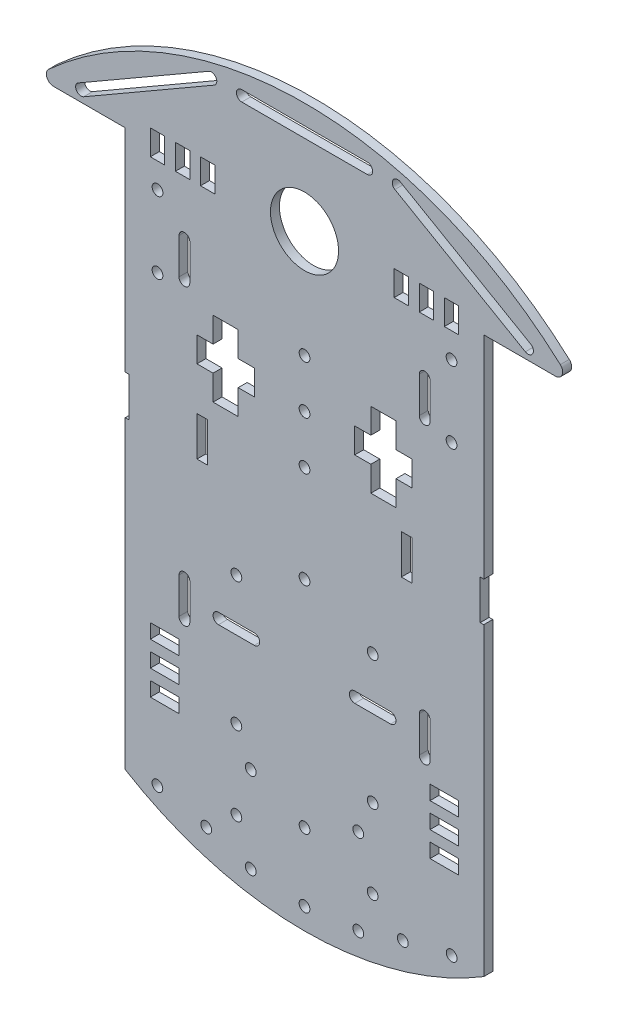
from build123d import *

# Parameters (mm, degrees)
BOSS_EXTRU_1_DEPTH         = 2.5
ESQUISSE2_R                = 9.5
ENL_V_MAT_EXTRU_1_DEPTH    = 223.451892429
ESQUISSE3_W                = 4
ESQUISSE3_H                = 7
ENL_V_MAT_EXTRU_2_DEPTH    = 223.451892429
R_P_TITION_LIN_AIRE1_COUNT = 3
R_P_TITION_LIN_AIRE1_PITCH = 7
ENL_V_MAT_EXTRU_3_DEPTH    = 223.451892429
ESQUISSE5_W                = 3
ESQUISSE5_H                = 11
ENL_V_MAT_EXTRU_4_DEPTH    = 223.451892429
R_P_TITION_LIN_AIRE2_COUNT = 2
R_P_TITION_LIN_AIRE2_PITCH = 22
ESQUISSE6_R                = 1.5
ENL_V_MAT_EXTRU_5_DEPTH    = 223.451892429
ESQUISSE7_W                = 8
ESQUISSE7_H                = 4
ENL_V_MAT_EXTRU_6_DEPTH    = 223.451892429
SYM_TRIE1_COPY_1_SKETCH_W  = 4
SYM_TRIE1_COPY_1_SKETCH_H  = 7
SYM_TRIE1_COPY_1_DEPTH     = 223.451892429
SYM_TRIE1_COPY_2_SKETCH_W  = 4
SYM_TRIE1_COPY_2_SKETCH_H  = 7
SYM_TRIE1_COPY_2_DEPTH     = 223.451892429
SYM_TRIE1_COPY_3_SKETCH_W  = 3
SYM_TRIE1_COPY_3_SKETCH_H  = 11
SYM_TRIE1_COPY_3_DEPTH     = 223.451892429
ESQUISSE8_R                = 1.5
ENL_V_MAT_EXTRU_7_DEPTH    = 10


with BuildPart() as part:
    # Esquisse1 → Boss.-Extru.1 (new body)
    with BuildSketch(Plane.XY):
        with BuildLine():
            Line((100, 155), (119.994239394, 155))
            ThreePointArc((119.994239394, 155), (121.860222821, 156.2802043), (121.337366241, 158.48189415))
            ThreePointArc((121.337366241, 158.48189415), (50, 186), (-21.337366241, 158.48189415))
            ThreePointArc((-21.337366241, 158.48189415), (-21.860222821, 156.2802043), (-19.994239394, 155))
            Line((-19.994239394, 155), (0, 155))
            Line((0, 155), (0, 0))
            ThreePointArc((0, 0), (50, -14), (100, 0))
            Line((100, 0), (100, 155))
        make_face()
    extrude(amount=BOSS_EXTRU_1_DEPTH)

    # Esquisse2 → Enl_v. mat.-Extru.1 (cut, through all)
    with BuildSketch(Plane(origin=(0, 0, 0), x_dir=(-1, 0, 0), z_dir=(0, 0, -1))):
        with Locations((-50, 155)):
            Circle(ESQUISSE2_R)
    extrude(amount=-ENL_V_MAT_EXTRU_1_DEPTH, mode=Mode.SUBTRACT)

    # Esquisse3 → Enl_v. mat.-Extru.2 (cut, through all)
    with BuildSketch(Plane(origin=(0, 0, 0), x_dir=(-1, 0, 0), z_dir=(0, 0, -1))):
        with Locations((-91, 155)):
            Rectangle(ESQUISSE3_W, ESQUISSE3_H)
    enl_v_mat_extru_2 = extrude(amount=-ENL_V_MAT_EXTRU_2_DEPTH, mode=Mode.SUBTRACT)

    # R_p_tition lin_aire1: Enl_v. mat.-Extru.2 ×3
    with Locations(*[(-i * R_P_TITION_LIN_AIRE1_PITCH, 0, 0) for i in range(1, R_P_TITION_LIN_AIRE1_COUNT)]):
        add(enl_v_mat_extru_2, mode=Mode.SUBTRACT)

    # Esquisse4 → Enl_v. mat.-Extru.3 (cut, through all)
    with BuildSketch(Plane(origin=(0, 0, 0), x_dir=(-1, 0, 0), z_dir=(0, 0, -1))):
        Polygon((-75.5, 122), (-68.5, 122), (-68.5, 115), (-64, 115), (-64, 108), (-68.5, 108), (-68.5, 101), (-75.5, 101), (-75.5, 108), (-80, 108), (-80, 115), (-75.5, 115), align=None)
    enl_v_mat_extru_3 = extrude(amount=-ENL_V_MAT_EXTRU_3_DEPTH, mode=Mode.SUBTRACT)

    # Esquisse5 → Enl_v. mat.-Extru.4 (cut, through all)
    with BuildSketch(Plane(origin=(0, 0, 0), x_dir=(-1, 0, 0), z_dir=(0, 0, -1))):
        with Locations((-78.5, 90.5)):
            Rectangle(ESQUISSE5_W, ESQUISSE5_H)
    enl_v_mat_extru_4 = extrude(amount=-ENL_V_MAT_EXTRU_4_DEPTH, mode=Mode.SUBTRACT)

    # R_p_tition lin_aire2: Enl_v. mat.-Extru.4 ×2
    with Locations(*[(i * R_P_TITION_LIN_AIRE2_PITCH, 0, 0) for i in range(1, R_P_TITION_LIN_AIRE2_COUNT)]):
        add(enl_v_mat_extru_4, mode=Mode.SUBTRACT)

    # Esquisse6 → Enl_v. mat.-Extru.5 (cut, through all)
    with BuildSketch(Plane(origin=(0, 0, 0), x_dir=(-1, 0, 0), z_dir=(0, 0, -1))):
        with Locations((-91, 144.5)):
            Circle(ESQUISSE6_R)
        with Locations((-91, 124.5)):
            Circle(ESQUISSE6_R)
        with Locations((-65, 17.5)):
            Circle(ESQUISSE6_R)
        with Locations((-69, 26.5)):
            Circle(ESQUISSE6_R)
        with Locations((-91.030029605, 0.602552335)):
            Circle(ESQUISSE6_R)
        with Locations((-77.401365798, -2.600496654)):
            Circle(ESQUISSE6_R)
        with Locations((-69, 4.5)):
            Circle(ESQUISSE6_R)
        with Locations((-65, -6.5)):
            Circle(ESQUISSE6_R)
        with Locations((-69, 62.5)):
            Circle(ESQUISSE6_R)
        with BuildLine():
            Line((-82, 54.5), (-82, 44.5))
            ThreePointArc((-82, 44.5), (-83.5, 43), (-85, 44.5))
            Line((-85, 44.5), (-85, 54.5))
            ThreePointArc((-85, 54.5), (-83.5, 56), (-82, 54.5))
        make_face()
        with BuildLine():
            Line((-74, 51), (-64, 51))
            ThreePointArc((-64, 51), (-62.5, 49.5), (-64, 48))
            Line((-64, 48), (-74, 48))
            ThreePointArc((-74, 48), (-75.5, 49.5), (-74, 51))
        make_face()
        with BuildLine():
            Line((-82, 136.5), (-82, 126.5))
            ThreePointArc((-82, 126.5), (-83.5, 125), (-85, 126.5))
            Line((-85, 126.5), (-85, 136.5))
            ThreePointArc((-85, 136.5), (-83.5, 138), (-82, 136.5))
        make_face()
        with BuildLine():
            Line((-113.087366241, 159.299038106), (-76.714299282, 180.299038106))
            ThreePointArc((-76.714299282, 180.299038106), (-74.665261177, 179.75), (-75.214299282, 177.700961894))
            Line((-75.214299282, 177.700961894), (-111.587366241, 156.700961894))
            ThreePointArc((-111.587366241, 156.700961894), (-113.636404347, 157.25), (-113.087366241, 159.299038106))
        make_face()
    enl_v_mat_extru_5 = extrude(amount=-ENL_V_MAT_EXTRU_5_DEPTH, mode=Mode.SUBTRACT)

    # Esquisse7 → Enl_v. mat.-Extru.6 (cut, through all)
    with BuildSketch(Plane(origin=(0, 0, 0), x_dir=(-1, 0, 0), z_dir=(0, 0, -1))):
        with Locations((-89, 37)):
            Rectangle(ESQUISSE7_W, ESQUISSE7_H)
        with Locations((-89, 30)):
            Rectangle(ESQUISSE7_W, ESQUISSE7_H)
        with Locations((-89, 23)):
            Rectangle(ESQUISSE7_W, ESQUISSE7_H)
    enl_v_mat_extru_6 = extrude(amount=-ENL_V_MAT_EXTRU_6_DEPTH, mode=Mode.SUBTRACT)

    # Sym_trie1: Enl_v. mat.-Extru.2, Enl_v. mat.-Extru.3, Enl_v. mat.-Extru.4, Enl_v. mat.-Extru.5, Enl_v. mat.-Extru.6 across plane
    add(enl_v_mat_extru_2.mirror(Plane(origin=(50, 0, 0), x_dir=(0, 0, 1), z_dir=(1, 0, 0))), mode=Mode.SUBTRACT)
    add(enl_v_mat_extru_3.mirror(Plane(origin=(50, 0, 0), x_dir=(0, 0, 1), z_dir=(1, 0, 0))), mode=Mode.SUBTRACT)
    add(enl_v_mat_extru_4.mirror(Plane(origin=(50, 0, 0), x_dir=(0, 0, 1), z_dir=(1, 0, 0))), mode=Mode.SUBTRACT)
    add(enl_v_mat_extru_5.mirror(Plane(origin=(50, 0, 0), x_dir=(0, 0, 1), z_dir=(1, 0, 0))), mode=Mode.SUBTRACT)
    add(enl_v_mat_extru_6.mirror(Plane(origin=(50, 0, 0), x_dir=(0, 0, 1), z_dir=(1, 0, 0))), mode=Mode.SUBTRACT)

    # Sym_trie1 copy 1 sketch → Sym_trie1 copy 1 (cut, through all)
    with BuildSketch(Plane(origin=(107, 0, 0), x_dir=(1, 0, 0), z_dir=(0, 0, -1))):
        with Locations((-91, -155)):
            Rectangle(SYM_TRIE1_COPY_1_SKETCH_W, SYM_TRIE1_COPY_1_SKETCH_H)
    extrude(amount=-SYM_TRIE1_COPY_1_DEPTH, mode=Mode.SUBTRACT)

    # Sym_trie1 copy 2 sketch → Sym_trie1 copy 2 (cut, through all)
    with BuildSketch(Plane(origin=(114, 0, 0), x_dir=(1, 0, 0), z_dir=(0, 0, -1))):
        with Locations((-91, -155)):
            Rectangle(SYM_TRIE1_COPY_2_SKETCH_W, SYM_TRIE1_COPY_2_SKETCH_H)
    extrude(amount=-SYM_TRIE1_COPY_2_DEPTH, mode=Mode.SUBTRACT)

    # Sym_trie1 copy 3 sketch → Sym_trie1 copy 3 (cut, through all)
    with BuildSketch(Plane(origin=(78, 0, 0), x_dir=(1, 0, 0), z_dir=(0, 0, -1))):
        with Locations((-78.5, -90.5)):
            Rectangle(SYM_TRIE1_COPY_3_SKETCH_W, SYM_TRIE1_COPY_3_SKETCH_H)
    extrude(amount=-SYM_TRIE1_COPY_3_DEPTH, mode=Mode.SUBTRACT)

    # Esquisse8 → Enl_v. mat.-Extru.7 (cut)
    with BuildSketch(Plane(origin=(0, 0, 0), x_dir=(-1, 0, 0), z_dir=(0, 0, -1))):
        with Locations((-50, 111.5)):
            Circle(ESQUISSE8_R)
        with Locations((-50, 125)):
            Circle(ESQUISSE8_R)
        with Locations((-50, 98)):
            Circle(ESQUISSE8_R)
        with Locations((-50, 71)):
            Circle(ESQUISSE8_R)
        with Locations((-50, -8)):
            Circle(ESQUISSE8_R)
        with Locations((-50, 11)):
            Circle(ESQUISSE8_R)
        with BuildLine():
            Line((-67.5, 180.480620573), (-32.5, 180.480620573))
            ThreePointArc((-32.5, 180.480620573), (-31, 178.980620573), (-32.5, 177.480620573))
            Line((-32.5, 177.480620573), (-67.5, 177.480620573))
            ThreePointArc((-67.5, 177.480620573), (-69, 178.980620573), (-67.5, 180.480620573))
        make_face()
    extrude(amount=-ENL_V_MAT_EXTRU_7_DEPTH, mode=Mode.SUBTRACT)


solid = part.part
